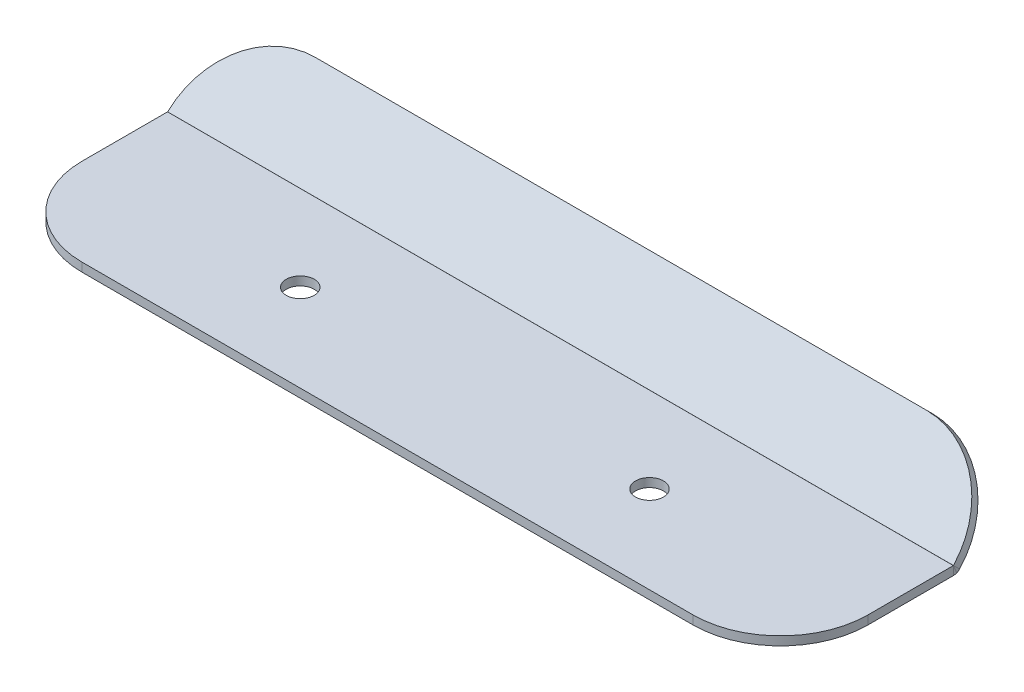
ISO-10303-21;
HEADER;
FILE_DESCRIPTION(('STEP AP214'),'2;1');
FILE_NAME('part.step','',(''),(''),'','','');
FILE_SCHEMA(('AUTOMOTIVE_DESIGN { 1 0 10303 214 1 1 1 1 }'));
ENDSEC;
DATA;
#1=APPLICATION_CONTEXT('core data for automotive mechanical design processes');
#2=APPLICATION_PROTOCOL_DEFINITION('international standard','automotive_design',2000,#1);
#3=PRODUCT_CONTEXT('',#1,'mechanical');
#4=PRODUCT('Part','Part','',(#3));
#5=PRODUCT_RELATED_PRODUCT_CATEGORY('part','',(#4));
#6=PRODUCT_DEFINITION_FORMATION('','',#4);
#7=PRODUCT_DEFINITION_CONTEXT('part definition',#1,'design');
#8=PRODUCT_DEFINITION('design','',#6,#7);
#9=PRODUCT_DEFINITION_SHAPE('','',#8);
#10=(LENGTH_UNIT() NAMED_UNIT(*) SI_UNIT(.MILLI.,.METRE.));
#11=(NAMED_UNIT(*) PLANE_ANGLE_UNIT() SI_UNIT($,.RADIAN.));
#12=(NAMED_UNIT(*) SI_UNIT($,.STERADIAN.) SOLID_ANGLE_UNIT());
#13=UNCERTAINTY_MEASURE_WITH_UNIT(LENGTH_MEASURE(1.E-05),#10,'distance_accuracy_value','');
#14=(GEOMETRIC_REPRESENTATION_CONTEXT(3) GLOBAL_UNCERTAINTY_ASSIGNED_CONTEXT((#13)) GLOBAL_UNIT_ASSIGNED_CONTEXT((#10,
#11,#12)) REPRESENTATION_CONTEXT('',''));
#15=CARTESIAN_POINT('',(0.,0.,0.));
#16=DIRECTION('',(0.,0.,1.));
#17=DIRECTION('',(1.,0.,0.));
#18=AXIS2_PLACEMENT_3D('',#15,#16,#17);
#19=CARTESIAN_POINT('',(10.,0.861312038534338,-19.6651776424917));
#20=DIRECTION('',(0.,-0.707106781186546,-0.707106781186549));
#21=DIRECTION('',(0.,0.707106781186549,-0.707106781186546));
#22=AXIS2_PLACEMENT_3D('',#19,#20,#21);
#23=CYLINDRICAL_SURFACE('',#22,10.);
#24=CARTESIAN_POINT('',(10.,0.154205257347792,-20.3722844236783));
#25=DIRECTION('',(0.,0.707106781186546,0.707106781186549));
#26=DIRECTION('',(0.,0.707106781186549,-0.707106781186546));
#27=AXIS2_PLACEMENT_3D('',#24,#25,#26);
#28=CIRCLE('',#27,10.);
#29=CARTESIAN_POINT('',(10.0000000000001,7.22527306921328,-27.4433522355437));
#30=VERTEX_POINT('',#29);
#31=CARTESIAN_POINT('',(0.00200573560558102,0.295822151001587,-20.5139013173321));
#32=VERTEX_POINT('',#31);
#33=EDGE_CURVE('E80',#30,#32,#28,.T.);
#34=ORIENTED_EDGE('',*,*,#33,.T.);
#35=CARTESIAN_POINT('',(0.00200573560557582,1.00292892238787,-19.8067945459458));
#36=CARTESIAN_POINT('',(0.00200573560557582,0.295822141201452,-20.5139013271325));
#37=B_SPLINE_CURVE_WITH_KNOTS('',1,(#35,#36),.UNSPECIFIED.,.F.,.F.,(2,2),(0.,1.),.UNSPECIFIED.);
#38=CARTESIAN_POINT('',(0.00200573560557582,1.00292892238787,-19.8067945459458));
#39=VERTEX_POINT('',#38);
#40=EDGE_CURVE('E248',#32,#39,#37,.F.);
#41=ORIENTED_EDGE('',*,*,#40,.T.);
#42=CARTESIAN_POINT('',(10.,0.861312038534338,-19.6651776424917));
#43=DIRECTION('',(0.,0.707106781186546,0.707106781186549));
#44=DIRECTION('',(0.,0.707106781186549,-0.707106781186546));
#45=AXIS2_PLACEMENT_3D('',#42,#43,#44);
#46=CIRCLE('',#45,10.);
#47=CARTESIAN_POINT('',(10.0000000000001,7.93237985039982,-26.7362454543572));
#48=VERTEX_POINT('',#47);
#49=EDGE_CURVE('E393',#48,#39,#46,.T.);
#50=ORIENTED_EDGE('',*,*,#49,.F.);
#51=DIRECTION('',(0.,-0.707106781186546,-0.707106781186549));
#52=VECTOR('',#51,1.);
#53=CARTESIAN_POINT('',(10.0000000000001,7.93237985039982,-26.7362454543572));
#54=LINE('',#53,#52);
#55=EDGE_CURVE('E472',#48,#30,#54,.T.);
#56=ORIENTED_EDGE('',*,*,#55,.T.);
#57=EDGE_LOOP('',(#34,#41,#50,#56));
#58=FACE_BOUND('',#57,.T.);
#59=ADVANCED_FACE('F54',(#58),#23,.T.);
#60=CARTESIAN_POINT('',(80.,0.861312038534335,-19.6651776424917));
#61=DIRECTION('',(0.,-0.707106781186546,-0.707106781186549));
#62=DIRECTION('',(0.,0.707106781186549,-0.707106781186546));
#63=AXIS2_PLACEMENT_3D('',#60,#61,#62);
#64=CYLINDRICAL_SURFACE('',#63,10.);
#65=CARTESIAN_POINT('',(80.,0.861312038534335,-19.6651776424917));
#66=DIRECTION('',(0.,0.707106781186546,0.707106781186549));
#67=DIRECTION('',(0.,-0.707106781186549,0.707106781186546));
#68=AXIS2_PLACEMENT_3D('',#65,#66,#67);
#69=CIRCLE('',#68,10.);
#70=CARTESIAN_POINT('',(89.9979942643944,1.00292893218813,-19.8067945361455));
#71=VERTEX_POINT('',#70);
#72=CARTESIAN_POINT('',(79.9999999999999,7.93237985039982,-26.7362454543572));
#73=VERTEX_POINT('',#72);
#74=EDGE_CURVE('E386',#71,#73,#69,.T.);
#75=ORIENTED_EDGE('',*,*,#74,.F.);
#76=CARTESIAN_POINT('',(89.9979942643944,0.295822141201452,-20.5139013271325));
#77=CARTESIAN_POINT('',(89.9979942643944,1.00292892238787,-19.8067945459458));
#78=B_SPLINE_CURVE_WITH_KNOTS('',1,(#76,#77),.UNSPECIFIED.,.F.,.F.,(2,2),(0.,1.),.UNSPECIFIED.);
#79=CARTESIAN_POINT('',(89.9979942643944,0.295822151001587,-20.5139013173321));
#80=VERTEX_POINT('',#79);
#81=EDGE_CURVE('E12',#71,#80,#78,.F.);
#82=ORIENTED_EDGE('',*,*,#81,.T.);
#83=CARTESIAN_POINT('',(80.,0.154205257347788,-20.3722844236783));
#84=DIRECTION('',(0.,0.707106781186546,0.707106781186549));
#85=DIRECTION('',(0.,-0.707106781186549,0.707106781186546));
#86=AXIS2_PLACEMENT_3D('',#83,#84,#85);
#87=CIRCLE('',#86,10.);
#88=CARTESIAN_POINT('',(79.9999999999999,7.22527306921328,-27.4433522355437));
#89=VERTEX_POINT('',#88);
#90=EDGE_CURVE('E73',#80,#89,#87,.T.);
#91=ORIENTED_EDGE('',*,*,#90,.T.);
#92=DIRECTION('',(0.,-0.707106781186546,-0.707106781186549));
#93=VECTOR('',#92,1.);
#94=CARTESIAN_POINT('',(79.9999999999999,7.93237985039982,-26.7362454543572));
#95=LINE('',#94,#93);
#96=EDGE_CURVE('E389',#73,#89,#95,.T.);
#97=ORIENTED_EDGE('',*,*,#96,.F.);
#98=EDGE_LOOP('',(#75,#82,#91,#97));
#99=FACE_BOUND('',#98,.T.);
#100=ADVANCED_FACE('F56',(#99),#64,.T.);
#101=CARTESIAN_POINT('',(80.,0.154205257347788,-20.3722844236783));
#102=DIRECTION('',(0.,0.707106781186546,0.707106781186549));
#103=DIRECTION('',(0.,-0.707106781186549,0.707106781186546));
#104=AXIS2_PLACEMENT_3D('',#101,#102,#103);
#105=PLANE('',#104);
#106=ORIENTED_EDGE('',*,*,#90,.F.);
#107=DIRECTION('',(-1.,0.,0.));
#108=VECTOR('',#107,1.);
#109=CARTESIAN_POINT('',(80.,0.295822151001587,-20.5139013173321));
#110=LINE('',#109,#108);
#111=EDGE_CURVE('E66',#80,#32,#110,.T.);
#112=ORIENTED_EDGE('',*,*,#111,.T.);
#113=ORIENTED_EDGE('',*,*,#33,.F.);
#114=DIRECTION('',(-1.,0.,0.));
#115=VECTOR('',#114,1.);
#116=CARTESIAN_POINT('',(10.0000000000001,7.22527306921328,-27.4433522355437));
#117=LINE('',#116,#115);
#118=EDGE_CURVE('E395',#89,#30,#117,.T.);
#119=ORIENTED_EDGE('',*,*,#118,.F.);
#120=EDGE_LOOP('',(#106,#112,#113,#119));
#121=FACE_BOUND('',#120,.T.);
#122=ADVANCED_FACE('F373',(#121),#105,.F.);
#123=CARTESIAN_POINT('',(80.,0.861312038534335,-19.6651776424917));
#124=DIRECTION('',(0.,0.707106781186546,0.707106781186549));
#125=DIRECTION('',(0.,-0.707106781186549,0.707106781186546));
#126=AXIS2_PLACEMENT_3D('',#123,#124,#125);
#127=PLANE('',#126);
#128=DIRECTION('',(-1.,0.,0.));
#129=VECTOR('',#128,1.);
#130=CARTESIAN_POINT('',(80.,1.00292893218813,-19.8067945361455));
#131=LINE('',#130,#129);
#132=EDGE_CURVE('E256',#71,#39,#131,.T.);
#133=ORIENTED_EDGE('',*,*,#132,.F.);
#134=ORIENTED_EDGE('',*,*,#74,.T.);
#135=DIRECTION('',(-1.,0.,0.));
#136=VECTOR('',#135,1.);
#137=CARTESIAN_POINT('',(10.0000000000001,7.93237985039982,-26.7362454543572));
#138=LINE('',#137,#136);
#139=EDGE_CURVE('E391',#73,#48,#138,.T.);
#140=ORIENTED_EDGE('',*,*,#139,.T.);
#141=ORIENTED_EDGE('',*,*,#49,.T.);
#142=EDGE_LOOP('',(#133,#134,#140,#141));
#143=FACE_BOUND('',#142,.T.);
#144=ADVANCED_FACE('F370',(#143),#127,.T.);
#145=CARTESIAN_POINT('',(10.0000000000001,7.93237985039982,-26.7362454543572));
#146=DIRECTION('',(0.,-0.707106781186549,0.707106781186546));
#147=DIRECTION('',(1.,0.,0.));
#148=AXIS2_PLACEMENT_3D('',#145,#146,#147);
#149=PLANE('',#148);
#150=ORIENTED_EDGE('',*,*,#118,.T.);
#151=ORIENTED_EDGE('',*,*,#55,.F.);
#152=ORIENTED_EDGE('',*,*,#139,.F.);
#153=ORIENTED_EDGE('',*,*,#96,.T.);
#154=EDGE_LOOP('',(#150,#151,#152,#153));
#155=FACE_BOUND('',#154,.T.);
#156=ADVANCED_FACE('F335',(#155),#149,.F.);
#157=CARTESIAN_POINT('',(80.,1.,-10.));
#158=DIRECTION('',(0.,-1.,0.));
#159=DIRECTION('',(0.,0.,-1.));
#160=AXIS2_PLACEMENT_3D('',#157,#158,#159);
#161=CYLINDRICAL_SURFACE('',#160,10.);
#162=CARTESIAN_POINT('',(80.,0.,-10.));
#163=DIRECTION('',(0.,1.,0.));
#164=DIRECTION('',(0.,0.,-1.));
#165=AXIS2_PLACEMENT_3D('',#162,#163,#164);
#166=CIRCLE('',#165,10.);
#167=CARTESIAN_POINT('',(79.9999999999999,0.,0.));
#168=VERTEX_POINT('',#167);
#169=CARTESIAN_POINT('',(90.,0.,-10.0000000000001));
#170=VERTEX_POINT('',#169);
#171=EDGE_CURVE('E466',#168,#170,#166,.T.);
#172=ORIENTED_EDGE('',*,*,#171,.T.);
#173=DIRECTION('',(0.,-1.,0.));
#174=VECTOR('',#173,1.);
#175=CARTESIAN_POINT('',(90.,1.,-10.0000000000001));
#176=LINE('',#175,#174);
#177=CARTESIAN_POINT('',(90.,1.,-10.0000000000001));
#178=VERTEX_POINT('',#177);
#179=EDGE_CURVE('E419',#178,#170,#176,.T.);
#180=ORIENTED_EDGE('',*,*,#179,.F.);
#181=CARTESIAN_POINT('',(80.,1.,-10.));
#182=DIRECTION('',(0.,1.,0.));
#183=DIRECTION('',(0.,0.,-1.));
#184=AXIS2_PLACEMENT_3D('',#181,#182,#183);
#185=CIRCLE('',#184,10.);
#186=CARTESIAN_POINT('',(79.9999999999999,1.,0.));
#187=VERTEX_POINT('',#186);
#188=EDGE_CURVE('E434',#187,#178,#185,.T.);
#189=ORIENTED_EDGE('',*,*,#188,.F.);
#190=DIRECTION('',(0.,-1.,0.));
#191=VECTOR('',#190,1.);
#192=CARTESIAN_POINT('',(79.9999999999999,1.,0.));
#193=LINE('',#192,#191);
#194=EDGE_CURVE('E463',#187,#168,#193,.T.);
#195=ORIENTED_EDGE('',*,*,#194,.T.);
#196=EDGE_LOOP('',(#172,#180,#189,#195));
#197=FACE_BOUND('',#196,.T.);
#198=ADVANCED_FACE('F331',(#197),#161,.T.);
#199=CARTESIAN_POINT('',(10.0000000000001,1.,0.));
#200=DIRECTION('',(0.,0.,-1.));
#201=DIRECTION('',(-1.,0.,0.));
#202=AXIS2_PLACEMENT_3D('',#199,#200,#201);
#203=PLANE('',#202);
#204=DIRECTION('',(1.,0.,0.));
#205=VECTOR('',#204,1.);
#206=CARTESIAN_POINT('',(10.0000000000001,0.,0.));
#207=LINE('',#206,#205);
#208=CARTESIAN_POINT('',(10.0000000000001,0.,0.));
#209=VERTEX_POINT('',#208);
#210=EDGE_CURVE('E461',#209,#168,#207,.T.);
#211=ORIENTED_EDGE('',*,*,#210,.T.);
#212=ORIENTED_EDGE('',*,*,#194,.F.);
#213=DIRECTION('',(1.,0.,0.));
#214=VECTOR('',#213,1.);
#215=CARTESIAN_POINT('',(10.0000000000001,1.,0.));
#216=LINE('',#215,#214);
#217=CARTESIAN_POINT('',(10.0000000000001,1.,0.));
#218=VERTEX_POINT('',#217);
#219=EDGE_CURVE('E436',#218,#187,#216,.T.);
#220=ORIENTED_EDGE('',*,*,#219,.F.);
#221=DIRECTION('',(0.,-1.,0.));
#222=VECTOR('',#221,1.);
#223=CARTESIAN_POINT('',(10.0000000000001,1.,0.));
#224=LINE('',#223,#222);
#225=EDGE_CURVE('E458',#218,#209,#224,.T.);
#226=ORIENTED_EDGE('',*,*,#225,.T.);
#227=EDGE_LOOP('',(#211,#212,#220,#226));
#228=FACE_BOUND('',#227,.T.);
#229=ADVANCED_FACE('F334',(#228),#203,.F.);
#230=CARTESIAN_POINT('',(10.,1.,-10.));
#231=DIRECTION('',(0.,-1.,0.));
#232=DIRECTION('',(0.,0.,-1.));
#233=AXIS2_PLACEMENT_3D('',#230,#231,#232);
#234=CYLINDRICAL_SURFACE('',#233,10.);
#235=CARTESIAN_POINT('',(10.,0.,-10.));
#236=DIRECTION('',(0.,1.,0.));
#237=DIRECTION('',(0.,0.,-1.));
#238=AXIS2_PLACEMENT_3D('',#235,#236,#237);
#239=CIRCLE('',#238,10.);
#240=CARTESIAN_POINT('',(0.,0.,-10.0000000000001));
#241=VERTEX_POINT('',#240);
#242=EDGE_CURVE('E456',#241,#209,#239,.T.);
#243=ORIENTED_EDGE('',*,*,#242,.T.);
#244=ORIENTED_EDGE('',*,*,#225,.F.);
#245=CARTESIAN_POINT('',(10.,1.,-10.));
#246=DIRECTION('',(0.,1.,0.));
#247=DIRECTION('',(0.,0.,-1.));
#248=AXIS2_PLACEMENT_3D('',#245,#246,#247);
#249=CIRCLE('',#248,10.);
#250=CARTESIAN_POINT('',(0.,1.,-10.0000000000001));
#251=VERTEX_POINT('',#250);
#252=EDGE_CURVE('E438',#251,#218,#249,.T.);
#253=ORIENTED_EDGE('',*,*,#252,.F.);
#254=DIRECTION('',(0.,-1.,0.));
#255=VECTOR('',#254,1.);
#256=CARTESIAN_POINT('',(0.,1.,-10.0000000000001));
#257=LINE('',#256,#255);
#258=EDGE_CURVE('E453',#251,#241,#257,.T.);
#259=ORIENTED_EDGE('',*,*,#258,.T.);
#260=EDGE_LOOP('',(#243,#244,#253,#259));
#261=FACE_BOUND('',#260,.T.);
#262=ADVANCED_FACE('F339',(#261),#234,.T.);
#263=CARTESIAN_POINT('',(25.,1.,-10.));
#264=DIRECTION('',(0.,-1.,0.));
#265=DIRECTION('',(0.,0.,-1.));
#266=AXIS2_PLACEMENT_3D('',#263,#264,#265);
#267=CYLINDRICAL_SURFACE('',#266,1.6);
#268=CARTESIAN_POINT('',(25.,1.,-10.));
#269=DIRECTION('',(0.,1.,0.));
#270=DIRECTION('',(0.,0.,-1.));
#271=AXIS2_PLACEMENT_3D('',#268,#269,#270);
#272=CIRCLE('',#271,1.6);
#273=CARTESIAN_POINT('',(25.,1.,-11.6));
#274=VERTEX_POINT('',#273);
#275=EDGE_CURVE('E450',#274,#274,#272,.T.);
#276=ORIENTED_EDGE('',*,*,#275,.T.);
#277=EDGE_LOOP('',(#276));
#278=FACE_BOUND('',#277,.T.);
#279=CARTESIAN_POINT('',(25.,0.,-10.));
#280=DIRECTION('',(0.,1.,0.));
#281=DIRECTION('',(0.,0.,-1.));
#282=AXIS2_PLACEMENT_3D('',#279,#280,#281);
#283=CIRCLE('',#282,1.6);
#284=CARTESIAN_POINT('',(25.,0.,-11.6));
#285=VERTEX_POINT('',#284);
#286=EDGE_CURVE('E423',#285,#285,#283,.T.);
#287=ORIENTED_EDGE('',*,*,#286,.F.);
#288=EDGE_LOOP('',(#287));
#289=FACE_BOUND('',#288,.T.);
#290=ADVANCED_FACE('F343',(#278,#289),#267,.F.);
#291=CARTESIAN_POINT('',(65.,1.,-10.));
#292=DIRECTION('',(0.,-1.,0.));
#293=DIRECTION('',(0.,0.,-1.));
#294=AXIS2_PLACEMENT_3D('',#291,#292,#293);
#295=CYLINDRICAL_SURFACE('',#294,1.6);
#296=CARTESIAN_POINT('',(65.,1.,-10.));
#297=DIRECTION('',(0.,1.,0.));
#298=DIRECTION('',(0.,0.,1.));
#299=AXIS2_PLACEMENT_3D('',#296,#297,#298);
#300=CIRCLE('',#299,1.6);
#301=CARTESIAN_POINT('',(65.,1.,-8.4));
#302=VERTEX_POINT('',#301);
#303=EDGE_CURVE('E447',#302,#302,#300,.T.);
#304=ORIENTED_EDGE('',*,*,#303,.T.);
#305=EDGE_LOOP('',(#304));
#306=FACE_BOUND('',#305,.T.);
#307=CARTESIAN_POINT('',(65.,0.,-10.));
#308=DIRECTION('',(0.,1.,0.));
#309=DIRECTION('',(0.,0.,1.));
#310=AXIS2_PLACEMENT_3D('',#307,#308,#309);
#311=CIRCLE('',#310,1.6);
#312=CARTESIAN_POINT('',(65.,0.,-8.4));
#313=VERTEX_POINT('',#312);
#314=EDGE_CURVE('E427',#313,#313,#311,.T.);
#315=ORIENTED_EDGE('',*,*,#314,.F.);
#316=EDGE_LOOP('',(#315));
#317=FACE_BOUND('',#316,.T.);
#318=ADVANCED_FACE('F347',(#306,#317),#295,.F.);
#319=CARTESIAN_POINT('',(80.,1.,-20.));
#320=DIRECTION('',(0.,1.,0.));
#321=DIRECTION('',(0.,0.,1.));
#322=AXIS2_PLACEMENT_3D('',#319,#320,#321);
#323=PLANE('',#322);
#324=ORIENTED_EDGE('',*,*,#303,.F.);
#325=EDGE_LOOP('',(#324));
#326=FACE_BOUND('',#325,.T.);
#327=ORIENTED_EDGE('',*,*,#275,.F.);
#328=EDGE_LOOP('',(#327));
#329=FACE_BOUND('',#328,.T.);
#330=DIRECTION('',(0.,0.,-1.));
#331=VECTOR('',#330,1.);
#332=CARTESIAN_POINT('',(90.,1.,-10.0000000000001));
#333=LINE('',#332,#331);
#334=CARTESIAN_POINT('',(90.,1.,-19.7997234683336));
#335=VERTEX_POINT('',#334);
#336=EDGE_CURVE('E445',#178,#335,#333,.T.);
#337=ORIENTED_EDGE('',*,*,#336,.T.);
#338=DIRECTION('',(-1.,0.,0.));
#339=VECTOR('',#338,1.);
#340=CARTESIAN_POINT('',(80.,1.,-19.7997234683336));
#341=LINE('',#340,#339);
#342=CARTESIAN_POINT('',(0.,0.999999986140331,-19.7997234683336));
#343=VERTEX_POINT('',#342);
#344=EDGE_CURVE('E442',#335,#343,#341,.T.);
#345=ORIENTED_EDGE('',*,*,#344,.T.);
#346=DIRECTION('',(0.,0.,1.));
#347=VECTOR('',#346,1.);
#348=CARTESIAN_POINT('',(0.,1.,-10.0000000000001));
#349=LINE('',#348,#347);
#350=EDGE_CURVE('E440',#343,#251,#349,.T.);
#351=ORIENTED_EDGE('',*,*,#350,.T.);
#352=ORIENTED_EDGE('',*,*,#252,.T.);
#353=ORIENTED_EDGE('',*,*,#219,.T.);
#354=ORIENTED_EDGE('',*,*,#188,.T.);
#355=EDGE_LOOP('',(#337,#345,#351,#352,#353,#354));
#356=FACE_BOUND('',#355,.T.);
#357=ADVANCED_FACE('F351',(#326,#329,#356),#323,.T.);
#358=CARTESIAN_POINT('',(0.,1.,-10.0000000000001));
#359=DIRECTION('',(1.,0.,0.));
#360=DIRECTION('',(0.,0.,-1.));
#361=AXIS2_PLACEMENT_3D('',#358,#359,#360);
#362=PLANE('',#361);
#363=DIRECTION('',(0.,1.,0.));
#364=VECTOR('',#363,1.);
#365=CARTESIAN_POINT('',(0.,0.999999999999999,-19.7997234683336));
#366=LINE('',#365,#364);
#367=CARTESIAN_POINT('',(0.,0.,-19.7997234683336));
#368=VERTEX_POINT('',#367);
#369=EDGE_CURVE('E311',#368,#343,#366,.T.);
#370=ORIENTED_EDGE('',*,*,#369,.F.);
#371=DIRECTION('',(0.,0.,1.));
#372=VECTOR('',#371,1.);
#373=CARTESIAN_POINT('',(0.,0.,-10.0000000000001));
#374=LINE('',#373,#372);
#375=EDGE_CURVE('E432',#368,#241,#374,.T.);
#376=ORIENTED_EDGE('',*,*,#375,.T.);
#377=ORIENTED_EDGE('',*,*,#258,.F.);
#378=ORIENTED_EDGE('',*,*,#350,.F.);
#379=EDGE_LOOP('',(#370,#376,#377,#378));
#380=FACE_BOUND('',#379,.T.);
#381=ADVANCED_FACE('F355',(#380),#362,.F.);
#382=CARTESIAN_POINT('',(80.,0.,-20.));
#383=DIRECTION('',(0.,1.,0.));
#384=DIRECTION('',(0.,0.,1.));
#385=AXIS2_PLACEMENT_3D('',#382,#383,#384);
#386=PLANE('',#385);
#387=DIRECTION('',(-1.,0.,0.));
#388=VECTOR('',#387,1.);
#389=CARTESIAN_POINT('',(80.,0.,-19.7997234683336));
#390=LINE('',#389,#388);
#391=CARTESIAN_POINT('',(90.,0.,-19.7997234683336));
#392=VERTEX_POINT('',#391);
#393=EDGE_CURVE('E469',#392,#368,#390,.T.);
#394=ORIENTED_EDGE('',*,*,#393,.F.);
#395=DIRECTION('',(0.,0.,-1.));
#396=VECTOR('',#395,1.);
#397=CARTESIAN_POINT('',(90.,0.,-10.0000000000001));
#398=LINE('',#397,#396);
#399=EDGE_CURVE('E321',#170,#392,#398,.T.);
#400=ORIENTED_EDGE('',*,*,#399,.F.);
#401=ORIENTED_EDGE('',*,*,#171,.F.);
#402=ORIENTED_EDGE('',*,*,#210,.F.);
#403=ORIENTED_EDGE('',*,*,#242,.F.);
#404=ORIENTED_EDGE('',*,*,#375,.F.);
#405=EDGE_LOOP('',(#394,#400,#401,#402,#403,#404));
#406=FACE_BOUND('',#405,.T.);
#407=ORIENTED_EDGE('',*,*,#314,.T.);
#408=EDGE_LOOP('',(#407));
#409=FACE_BOUND('',#408,.T.);
#410=ORIENTED_EDGE('',*,*,#286,.T.);
#411=EDGE_LOOP('',(#410));
#412=FACE_BOUND('',#411,.T.);
#413=ADVANCED_FACE('F359',(#406,#409,#412),#386,.F.);
#414=CARTESIAN_POINT('',(90.,1.,-10.0000000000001));
#415=DIRECTION('',(-1.,0.,0.));
#416=DIRECTION('',(0.,0.,1.));
#417=AXIS2_PLACEMENT_3D('',#414,#415,#416);
#418=PLANE('',#417);
#419=DIRECTION('',(0.,-1.,0.));
#420=VECTOR('',#419,1.);
#421=CARTESIAN_POINT('',(90.,0.999999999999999,-19.7997234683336));
#422=LINE('',#421,#420);
#423=EDGE_CURVE('E162',#335,#392,#422,.T.);
#424=ORIENTED_EDGE('',*,*,#423,.F.);
#425=ORIENTED_EDGE('',*,*,#336,.F.);
#426=ORIENTED_EDGE('',*,*,#179,.T.);
#427=ORIENTED_EDGE('',*,*,#399,.T.);
#428=EDGE_LOOP('',(#424,#425,#426,#427));
#429=FACE_BOUND('',#428,.T.);
#430=ADVANCED_FACE('F363',(#429),#418,.F.);
#431=CARTESIAN_POINT('',(90.,1.01000001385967,-19.7997234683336));
#432=DIRECTION('',(-1.,0.,0.));
#433=DIRECTION('',(0.,0.,1.));
#434=AXIS2_PLACEMENT_3D('',#431,#432,#433);
#435=PLANE('',#434);
#436=ORIENTED_EDGE('',*,*,#423,.T.);
#437=CARTESIAN_POINT('',(90.,1.01,-19.7997234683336));
#438=DIRECTION('',(-1.,0.,0.));
#439=DIRECTION('',(0.,0.,1.));
#440=AXIS2_PLACEMENT_3D('',#437,#438,#439);
#441=CIRCLE('',#440,1.01000001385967);
#442=CARTESIAN_POINT('',(90.,0.0768816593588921,-20.1862337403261));
#443=VERTEX_POINT('',#442);
#444=EDGE_CURVE('E173',#392,#443,#441,.F.);
#445=ORIENTED_EDGE('',*,*,#444,.T.);
#446=CARTESIAN_POINT('',(90.,1.00076119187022,-19.8035503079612));
#447=CARTESIAN_POINT('',(90.,0.0768816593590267,-20.1862337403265));
#448=B_SPLINE_CURVE_WITH_KNOTS('',1,(#446,#447),.UNSPECIFIED.,.F.,.F.,(2,2),(0.,1.),.UNSPECIFIED.);
#449=CARTESIAN_POINT('',(90.,1.00076119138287,-19.803550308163));
#450=VERTEX_POINT('',#449);
#451=EDGE_CURVE('E147',#443,#450,#448,.F.);
#452=ORIENTED_EDGE('',*,*,#451,.T.);
#453=CARTESIAN_POINT('',(90.,1.01000001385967,-19.7997234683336));
#454=DIRECTION('',(1.,0.,0.));
#455=DIRECTION('',(0.,0.,-1.));
#456=AXIS2_PLACEMENT_3D('',#453,#454,#455);
#457=CIRCLE('',#456,0.0100000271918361);
#458=EDGE_CURVE('E304',#335,#450,#457,.T.);
#459=ORIENTED_EDGE('',*,*,#458,.F.);
#460=EDGE_LOOP('',(#436,#445,#452,#459));
#461=FACE_BOUND('',#460,.T.);
#462=ADVANCED_FACE('F178',(#461),#435,.F.);
#463=CARTESIAN_POINT('',(90.,0.0768816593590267,-20.1862337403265));
#464=CARTESIAN_POINT('',(89.9997601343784,0.133123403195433,-20.3220133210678));
#465=CARTESIAN_POINT('',(89.9990898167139,0.212755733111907,-20.4308349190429));
#466=CARTESIAN_POINT('',(89.9979942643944,0.295822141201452,-20.5139013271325));
#467=CARTESIAN_POINT('',(90.,1.00076119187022,-19.8035503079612));
#468=CARTESIAN_POINT('',(89.9997599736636,1.00131841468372,-19.8048955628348));
#469=CARTESIAN_POINT('',(89.9990913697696,1.00210531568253,-19.8059709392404));
#470=CARTESIAN_POINT('',(89.9979942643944,1.00292892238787,-19.8067945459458));
#471=B_SPLINE_SURFACE_WITH_KNOTS('',1,3,((#463,#464,#465,#466),(#467,#468,#469,#470)),
.UNSPECIFIED.,.F.,.F.,.F.,(2,2),(4,4),(0.,1.),(0.,1.),.UNSPECIFIED.);
#472=CARTESIAN_POINT('',(90.,0.0768816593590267,-20.1862337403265));
#473=CARTESIAN_POINT('',(89.9997601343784,0.133123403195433,-20.3220133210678));
#474=CARTESIAN_POINT('',(89.9990898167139,0.212755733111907,-20.4308349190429));
#475=CARTESIAN_POINT('',(89.9979942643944,0.295822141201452,-20.5139013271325));
#476=B_SPLINE_CURVE_WITH_KNOTS('',3,(#472,#473,#474,#475),.UNSPECIFIED.,.F.,.F.,(4,4),(0.,1.),.UNSPECIFIED.);
#477=EDGE_CURVE('E152',#443,#80,#476,.T.);
#478=CARTESIAN_POINT('',(89.9979942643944,1.00292892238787,-19.8067945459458));
#479=CARTESIAN_POINT('',(89.9990913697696,1.00210531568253,-19.8059709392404));
#480=CARTESIAN_POINT('',(89.9997599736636,1.00131841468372,-19.8048955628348));
#481=CARTESIAN_POINT('',(90.,1.00076119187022,-19.8035503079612));
#482=B_SPLINE_CURVE_WITH_KNOTS('',3,(#478,#479,#480,#481),.UNSPECIFIED.,.F.,.F.,(4,4),(0.,1.),.UNSPECIFIED.);
#483=EDGE_CURVE('E155',#450,#71,#482,.F.);
#484=ORIENTED_EDGE('',*,*,#451,.F.);
#485=ORIENTED_EDGE('',*,*,#477,.T.);
#486=ORIENTED_EDGE('',*,*,#81,.F.);
#487=ORIENTED_EDGE('',*,*,#483,.F.);
#488=EDGE_LOOP('',(#484,#485,#486,#487));
#489=FACE_BOUND('',#488,.T.);
#490=ADVANCED_FACE('F150',(#489),#471,.F.);
#491=CARTESIAN_POINT('',(0.00200573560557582,0.295822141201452,-20.5139013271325));
#492=CARTESIAN_POINT('',(0.000910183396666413,0.212755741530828,-20.4308349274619));
#493=CARTESIAN_POINT('',(0.000239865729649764,0.133123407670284,-20.3220133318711));
#494=CARTESIAN_POINT('',(0.,0.0768816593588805,-20.1862337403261));
#495=CARTESIAN_POINT('',(0.00200573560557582,1.00292892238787,-19.8067945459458));
#496=CARTESIAN_POINT('',(0.000908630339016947,1.00210531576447,-19.8059709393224));
#497=CARTESIAN_POINT('',(0.000240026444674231,1.00131841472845,-19.8048955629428));
#498=CARTESIAN_POINT('',(0.,1.00076119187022,-19.8035503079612));
#499=B_SPLINE_SURFACE_WITH_KNOTS('',1,3,((#491,#492,#493,#494),(#495,#496,#497,#498)),
.UNSPECIFIED.,.F.,.F.,.F.,(2,2),(4,4),(0.,1.),(0.,1.),.UNSPECIFIED.);
#500=CARTESIAN_POINT('',(0.00200573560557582,0.295822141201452,-20.5139013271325));
#501=CARTESIAN_POINT('',(0.000910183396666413,0.212755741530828,-20.4308349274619));
#502=CARTESIAN_POINT('',(0.000239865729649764,0.133123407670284,-20.3220133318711));
#503=CARTESIAN_POINT('',(0.,0.0768816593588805,-20.1862337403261));
#504=B_SPLINE_CURVE_WITH_KNOTS('',3,(#500,#501,#502,#503),.UNSPECIFIED.,.F.,.F.,(4,4),(0.,1.),.UNSPECIFIED.);
#505=CARTESIAN_POINT('',(0.,0.0768816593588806,-20.1862337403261));
#506=VERTEX_POINT('',#505);
#507=EDGE_CURVE('E174',#32,#506,#504,.T.);
#508=CARTESIAN_POINT('',(0.,0.0768816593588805,-20.1862337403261));
#509=CARTESIAN_POINT('',(0.,1.00076119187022,-19.8035503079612));
#510=B_SPLINE_CURVE_WITH_KNOTS('',1,(#508,#509),.UNSPECIFIED.,.F.,.F.,(2,2),(0.,1.),.UNSPECIFIED.);
#511=CARTESIAN_POINT('',(0.,1.00076119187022,-19.8035503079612));
#512=VERTEX_POINT('',#511);
#513=EDGE_CURVE('E163',#506,#512,#510,.T.);
#514=CARTESIAN_POINT('',(0.,1.00076119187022,-19.8035503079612));
#515=CARTESIAN_POINT('',(0.000240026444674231,1.00131841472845,-19.8048955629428));
#516=CARTESIAN_POINT('',(0.000908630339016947,1.00210531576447,-19.8059709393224));
#517=CARTESIAN_POINT('',(0.00200573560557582,1.00292892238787,-19.8067945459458));
#518=B_SPLINE_CURVE_WITH_KNOTS('',3,(#514,#515,#516,#517),.UNSPECIFIED.,.F.,.F.,(4,4),(0.,1.),.UNSPECIFIED.);
#519=EDGE_CURVE('E252',#39,#512,#518,.F.);
#520=ORIENTED_EDGE('',*,*,#40,.F.);
#521=ORIENTED_EDGE('',*,*,#507,.T.);
#522=ORIENTED_EDGE('',*,*,#513,.T.);
#523=ORIENTED_EDGE('',*,*,#519,.F.);
#524=EDGE_LOOP('',(#520,#521,#522,#523));
#525=FACE_BOUND('',#524,.T.);
#526=ADVANCED_FACE('F202',(#525),#499,.F.);
#527=CARTESIAN_POINT('',(0.,1.01000001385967,-19.7997234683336));
#528=DIRECTION('',(1.,0.,0.));
#529=DIRECTION('',(0.,0.,-1.));
#530=AXIS2_PLACEMENT_3D('',#527,#528,#529);
#531=PLANE('',#530);
#532=CARTESIAN_POINT('',(0.,1.01,-19.7997234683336));
#533=DIRECTION('',(-1.,0.,0.));
#534=DIRECTION('',(0.,0.,1.));
#535=AXIS2_PLACEMENT_3D('',#532,#533,#534);
#536=CIRCLE('',#535,1.01000001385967);
#537=EDGE_CURVE('E259',#506,#368,#536,.T.);
#538=ORIENTED_EDGE('',*,*,#537,.T.);
#539=ORIENTED_EDGE('',*,*,#369,.T.);
#540=CARTESIAN_POINT('',(0.,1.01000001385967,-19.7997234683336));
#541=DIRECTION('',(-1.,0.,0.));
#542=DIRECTION('',(0.,0.,1.));
#543=AXIS2_PLACEMENT_3D('',#540,#541,#542);
#544=CIRCLE('',#543,0.0100000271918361);
#545=EDGE_CURVE('E299',#512,#343,#544,.T.);
#546=ORIENTED_EDGE('',*,*,#545,.F.);
#547=ORIENTED_EDGE('',*,*,#513,.F.);
#548=EDGE_LOOP('',(#538,#539,#546,#547));
#549=FACE_BOUND('',#548,.T.);
#550=ADVANCED_FACE('F276',(#549),#531,.F.);
#551=CARTESIAN_POINT('',(135.006446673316,1.01,-19.7997234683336));
#552=DIRECTION('',(-1.,0.,0.));
#553=DIRECTION('',(0.,0.,1.));
#554=AXIS2_PLACEMENT_3D('',#551,#552,#553);
#555=CYLINDRICAL_SURFACE('',#554,0.0100000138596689);
#556=ORIENTED_EDGE('',*,*,#519,.T.);
#557=ORIENTED_EDGE('',*,*,#545,.T.);
#558=ORIENTED_EDGE('',*,*,#344,.F.);
#559=ORIENTED_EDGE('',*,*,#458,.T.);
#560=ORIENTED_EDGE('',*,*,#483,.T.);
#561=ORIENTED_EDGE('',*,*,#132,.T.);
#562=EDGE_LOOP('',(#556,#557,#558,#559,#560,#561));
#563=FACE_BOUND('',#562,.T.);
#564=ADVANCED_FACE('F275',(#563),#555,.F.);
#565=CARTESIAN_POINT('',(135.006446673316,1.01,-19.7997234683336));
#566=DIRECTION('',(-1.,0.,0.));
#567=DIRECTION('',(0.,0.,1.));
#568=AXIS2_PLACEMENT_3D('',#565,#566,#567);
#569=CYLINDRICAL_SURFACE('',#568,1.01000001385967);
#570=ORIENTED_EDGE('',*,*,#507,.F.);
#571=ORIENTED_EDGE('',*,*,#111,.F.);
#572=ORIENTED_EDGE('',*,*,#477,.F.);
#573=ORIENTED_EDGE('',*,*,#444,.F.);
#574=ORIENTED_EDGE('',*,*,#393,.T.);
#575=ORIENTED_EDGE('',*,*,#537,.F.);
#576=EDGE_LOOP('',(#570,#571,#572,#573,#574,#575));
#577=FACE_BOUND('',#576,.T.);
#578=ADVANCED_FACE('F171',(#577),#569,.T.);
#579=CLOSED_SHELL('',(#59,#100,#122,#144,#156,#198,#229,#262,#290,#318,#357,#381,#413,#430,#462,
#490,#526,#550,#564,#578));
#580=MANIFOLD_SOLID_BREP('B2',#579);
#581=ADVANCED_BREP_SHAPE_REPRESENTATION('',(#18,#580),#14);
#582=SHAPE_DEFINITION_REPRESENTATION(#9,#581);
ENDSEC;
END-ISO-10303-21;
